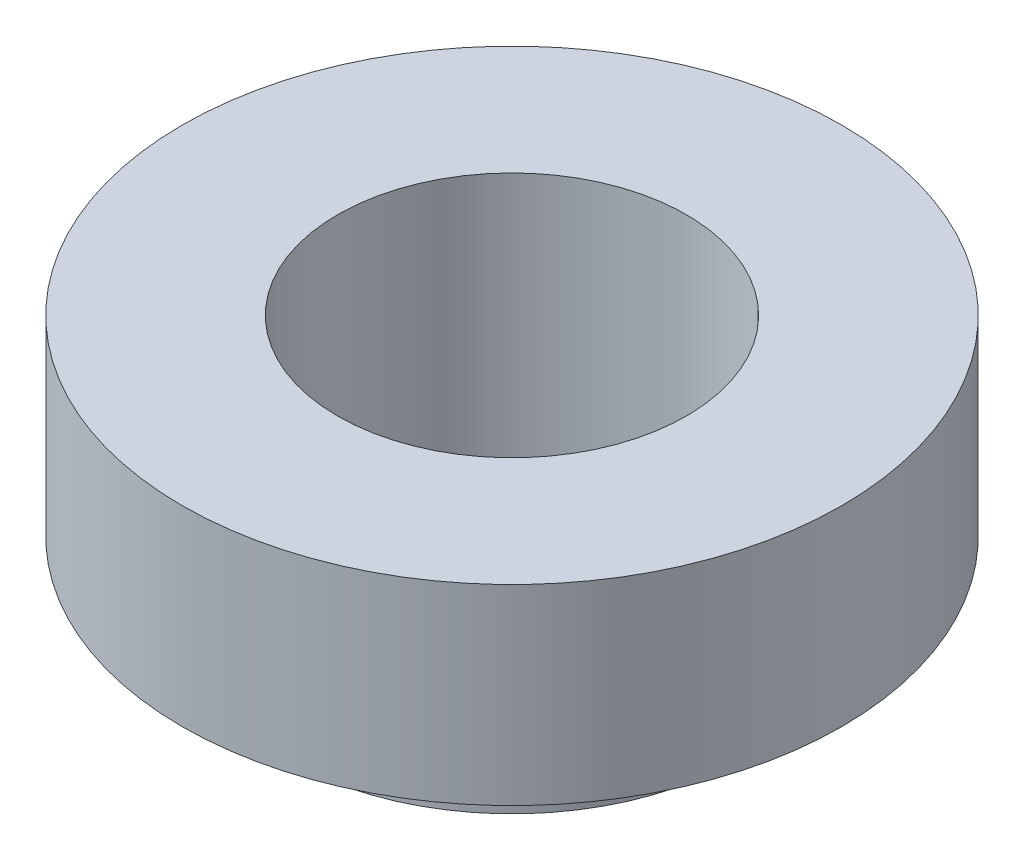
ISO-10303-21;
HEADER;
FILE_DESCRIPTION(('STEP AP214'),'2;1');
FILE_NAME('part.step','',(''),(''),'','','');
FILE_SCHEMA(('AUTOMOTIVE_DESIGN { 1 0 10303 214 1 1 1 1 }'));
ENDSEC;
DATA;
#1=APPLICATION_CONTEXT('core data for automotive mechanical design processes');
#2=APPLICATION_PROTOCOL_DEFINITION('international standard','automotive_design',2000,#1);
#3=PRODUCT_CONTEXT('',#1,'mechanical');
#4=PRODUCT('Part','Part','',(#3));
#5=PRODUCT_RELATED_PRODUCT_CATEGORY('part','',(#4));
#6=PRODUCT_DEFINITION_FORMATION('','',#4);
#7=PRODUCT_DEFINITION_CONTEXT('part definition',#1,'design');
#8=PRODUCT_DEFINITION('design','',#6,#7);
#9=PRODUCT_DEFINITION_SHAPE('','',#8);
#10=(LENGTH_UNIT() NAMED_UNIT(*) SI_UNIT(.MILLI.,.METRE.));
#11=(NAMED_UNIT(*) PLANE_ANGLE_UNIT() SI_UNIT($,.RADIAN.));
#12=(NAMED_UNIT(*) SI_UNIT($,.STERADIAN.) SOLID_ANGLE_UNIT());
#13=UNCERTAINTY_MEASURE_WITH_UNIT(LENGTH_MEASURE(1.E-05),#10,'distance_accuracy_value','');
#14=(GEOMETRIC_REPRESENTATION_CONTEXT(3) GLOBAL_UNCERTAINTY_ASSIGNED_CONTEXT((#13)) GLOBAL_UNIT_ASSIGNED_CONTEXT((#10,
#11,#12)) REPRESENTATION_CONTEXT('',''));
#15=CARTESIAN_POINT('',(0.,0.,0.));
#16=DIRECTION('',(0.,0.,1.));
#17=DIRECTION('',(1.,0.,0.));
#18=AXIS2_PLACEMENT_3D('',#15,#16,#17);
#19=CARTESIAN_POINT('',(0.,0.9652,0.));
#20=DIRECTION('',(0.,-1.,0.));
#21=DIRECTION('',(0.,0.,-1.));
#22=AXIS2_PLACEMENT_3D('',#19,#20,#21);
#23=CYLINDRICAL_SURFACE('',#22,2.6924);
#24=CARTESIAN_POINT('',(0.,0.9652,0.));
#25=DIRECTION('',(0.,1.,0.));
#26=DIRECTION('',(0.,0.,1.));
#27=AXIS2_PLACEMENT_3D('',#24,#25,#26);
#28=CIRCLE('',#27,2.6924);
#29=CARTESIAN_POINT('',(0.,0.9652,-2.6924));
#30=VERTEX_POINT('',#29);
#31=EDGE_CURVE('E10',#30,#30,#28,.T.);
#32=CARTESIAN_POINT('',(0.,0.,0.));
#33=DIRECTION('',(0.,1.,0.));
#34=DIRECTION('',(0.,0.,1.));
#35=AXIS2_PLACEMENT_3D('',#32,#33,#34);
#36=CIRCLE('',#35,2.6924);
#37=CARTESIAN_POINT('',(0.,0.,-2.6924));
#38=VERTEX_POINT('',#37);
#39=EDGE_CURVE('E33',#38,#38,#36,.T.);
#40=CARTESIAN_POINT('',(0.,0.9652,-2.6924));
#41=CARTESIAN_POINT('',(0.,0.955145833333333,-2.6924));
#42=CARTESIAN_POINT('',(0.,0.945091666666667,-2.6924));
#43=CARTESIAN_POINT('',(0.,0.924983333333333,-2.6924));
#44=CARTESIAN_POINT('',(0.,0.914929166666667,-2.6924));
#45=CARTESIAN_POINT('',(0.,0.894820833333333,-2.6924));
#46=CARTESIAN_POINT('',(0.,0.884766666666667,-2.6924));
#47=CARTESIAN_POINT('',(0.,0.864658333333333,-2.6924));
#48=CARTESIAN_POINT('',(0.,0.854604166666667,-2.6924));
#49=CARTESIAN_POINT('',(0.,0.834495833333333,-2.6924));
#50=CARTESIAN_POINT('',(0.,0.824441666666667,-2.6924));
#51=CARTESIAN_POINT('',(0.,0.804333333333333,-2.6924));
#52=CARTESIAN_POINT('',(0.,0.794279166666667,-2.6924));
#53=CARTESIAN_POINT('',(0.,0.774170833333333,-2.6924));
#54=CARTESIAN_POINT('',(0.,0.764116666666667,-2.6924));
#55=CARTESIAN_POINT('',(0.,0.744008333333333,-2.6924));
#56=CARTESIAN_POINT('',(0.,0.733954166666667,-2.6924));
#57=CARTESIAN_POINT('',(0.,0.713845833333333,-2.6924));
#58=CARTESIAN_POINT('',(0.,0.703791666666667,-2.6924));
#59=CARTESIAN_POINT('',(0.,0.683683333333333,-2.6924));
#60=CARTESIAN_POINT('',(0.,0.673629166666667,-2.6924));
#61=CARTESIAN_POINT('',(0.,0.653520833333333,-2.6924));
#62=CARTESIAN_POINT('',(0.,0.643466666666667,-2.6924));
#63=CARTESIAN_POINT('',(0.,0.623358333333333,-2.6924));
#64=CARTESIAN_POINT('',(0.,0.613304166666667,-2.6924));
#65=CARTESIAN_POINT('',(0.,0.593195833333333,-2.6924));
#66=CARTESIAN_POINT('',(0.,0.583141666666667,-2.6924));
#67=CARTESIAN_POINT('',(0.,0.563033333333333,-2.6924));
#68=CARTESIAN_POINT('',(0.,0.552979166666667,-2.6924));
#69=CARTESIAN_POINT('',(0.,0.532870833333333,-2.6924));
#70=CARTESIAN_POINT('',(0.,0.522816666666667,-2.6924));
#71=CARTESIAN_POINT('',(0.,0.502708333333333,-2.6924));
#72=CARTESIAN_POINT('',(0.,0.492654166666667,-2.6924));
#73=CARTESIAN_POINT('',(0.,0.472545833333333,-2.6924));
#74=CARTESIAN_POINT('',(0.,0.462491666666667,-2.6924));
#75=CARTESIAN_POINT('',(0.,0.442383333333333,-2.6924));
#76=CARTESIAN_POINT('',(0.,0.432329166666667,-2.6924));
#77=CARTESIAN_POINT('',(0.,0.412220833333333,-2.6924));
#78=CARTESIAN_POINT('',(0.,0.402166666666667,-2.6924));
#79=CARTESIAN_POINT('',(0.,0.382058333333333,-2.6924));
#80=CARTESIAN_POINT('',(0.,0.372004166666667,-2.6924));
#81=CARTESIAN_POINT('',(0.,0.351895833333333,-2.6924));
#82=CARTESIAN_POINT('',(0.,0.341841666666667,-2.6924));
#83=CARTESIAN_POINT('',(0.,0.321733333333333,-2.6924));
#84=CARTESIAN_POINT('',(0.,0.311679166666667,-2.6924));
#85=CARTESIAN_POINT('',(0.,0.291570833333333,-2.6924));
#86=CARTESIAN_POINT('',(0.,0.281516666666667,-2.6924));
#87=CARTESIAN_POINT('',(0.,0.261408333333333,-2.6924));
#88=CARTESIAN_POINT('',(0.,0.251354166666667,-2.6924));
#89=CARTESIAN_POINT('',(0.,0.231245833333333,-2.6924));
#90=CARTESIAN_POINT('',(0.,0.221191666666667,-2.6924));
#91=CARTESIAN_POINT('',(0.,0.201083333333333,-2.6924));
#92=CARTESIAN_POINT('',(0.,0.191029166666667,-2.6924));
#93=CARTESIAN_POINT('',(0.,0.170920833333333,-2.6924));
#94=CARTESIAN_POINT('',(0.,0.160866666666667,-2.6924));
#95=CARTESIAN_POINT('',(0.,0.140758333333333,-2.6924));
#96=CARTESIAN_POINT('',(0.,0.130704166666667,-2.6924));
#97=CARTESIAN_POINT('',(0.,0.110595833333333,-2.6924));
#98=CARTESIAN_POINT('',(0.,0.100541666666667,-2.6924));
#99=CARTESIAN_POINT('',(0.,0.0804333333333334,-2.6924));
#100=CARTESIAN_POINT('',(0.,0.0703791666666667,-2.6924));
#101=CARTESIAN_POINT('',(0.,0.0502708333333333,-2.6924));
#102=CARTESIAN_POINT('',(0.,0.0402166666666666,-2.6924));
#103=CARTESIAN_POINT('',(0.,0.0201083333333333,-2.6924));
#104=CARTESIAN_POINT('',(0.,0.0100541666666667,-2.6924));
#105=CARTESIAN_POINT('',(0.,0.,-2.6924));
#106=B_SPLINE_CURVE_WITH_KNOTS('',3,(#40,#41,#42,#43,#44,#45,#46,#47,#48,#49,#50,#51,#52,#53,
#54,#55,#56,#57,#58,#59,#60,#61,#62,#63,#64,#65,#66,#67,#68,#69,#70,#71,#72,#73,#74,#75,#76,#77,
#78,#79,#80,#81,#82,#83,#84,#85,#86,#87,#88,#89,#90,#91,#92,#93,#94,#95,#96,#97,#98,#99,#100,
#101,#102,#103,#104,#105),.UNSPECIFIED.,.F.,.F.,(4,2,2,2,2,2,2,2,2,2,2,2,2,2,2,2,2,2,2,2,2,2,2,
2,2,2,2,2,2,2,2,2,4),(0.,0.0301625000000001,0.0603250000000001,0.0904875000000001,0.12065,
0.1508125,0.180975,0.2111375,0.2413,0.2714625,0.301625,0.3317875,0.36195,0.3921125,0.422275,
0.4524375,0.4826,0.5127625,0.542925,0.5730875,0.60325,0.6334125,0.663575,0.6937375,0.7239,
0.7540625,0.784225,0.8143875,0.84455,0.8747125,0.904875,0.9350375,0.9652),.UNSPECIFIED.);
#107=EDGE_CURVE('BSEAM30',#30,#38,#106,.T.);
#108=ORIENTED_EDGE('',*,*,#31,.F.);
#109=ORIENTED_EDGE('',*,*,#39,.T.);
#110=ORIENTED_EDGE('',*,*,#107,.T.);
#111=ORIENTED_EDGE('',*,*,#107,.F.);
#112=EDGE_LOOP('',(#108,#110,#109,#111));
#113=FACE_BOUND('',#112,.T.);
#114=ADVANCED_FACE('F30',(#113),#23,.T.);
#115=CARTESIAN_POINT('',(0.,0.,0.));
#116=DIRECTION('',(0.,1.,0.));
#117=DIRECTION('',(0.,0.,1.));
#118=AXIS2_PLACEMENT_3D('',#115,#116,#117);
#119=PLANE('',#118);
#120=CARTESIAN_POINT('',(0.,0.,0.));
#121=DIRECTION('',(0.,1.,0.));
#122=DIRECTION('',(0.,0.,1.));
#123=AXIS2_PLACEMENT_3D('',#120,#121,#122);
#124=CIRCLE('',#123,2.0828);
#125=CARTESIAN_POINT('',(0.,0.,2.0828));
#126=VERTEX_POINT('',#125);
#127=EDGE_CURVE('E45',#126,#126,#124,.T.);
#128=ORIENTED_EDGE('',*,*,#127,.T.);
#129=EDGE_LOOP('',(#128));
#130=FACE_BOUND('',#129,.T.);
#131=ORIENTED_EDGE('',*,*,#39,.F.);
#132=EDGE_LOOP('',(#131));
#133=FACE_BOUND('',#132,.T.);
#134=ADVANCED_FACE('F54',(#130,#133),#119,.F.);
#135=CARTESIAN_POINT('',(0.,0.9652,0.));
#136=DIRECTION('',(0.,1.,0.));
#137=DIRECTION('',(0.,0.,1.));
#138=AXIS2_PLACEMENT_3D('',#135,#136,#137);
#139=PLANE('',#138);
#140=CARTESIAN_POINT('',(0.,0.9652,0.));
#141=DIRECTION('',(0.,1.,0.));
#142=DIRECTION('',(0.,0.,1.));
#143=AXIS2_PLACEMENT_3D('',#140,#141,#142);
#144=CIRCLE('',#143,3.937);
#145=CARTESIAN_POINT('',(0.,0.9652,3.937));
#146=VERTEX_POINT('',#145);
#147=EDGE_CURVE('E42',#146,#146,#144,.T.);
#148=ORIENTED_EDGE('',*,*,#147,.F.);
#149=EDGE_LOOP('',(#148));
#150=FACE_BOUND('',#149,.T.);
#151=ORIENTED_EDGE('',*,*,#31,.T.);
#152=EDGE_LOOP('',(#151));
#153=FACE_BOUND('',#152,.T.);
#154=ADVANCED_FACE('F72',(#150,#153),#139,.F.);
#155=CARTESIAN_POINT('',(0.,3.2512,0.));
#156=DIRECTION('',(0.,-1.,0.));
#157=DIRECTION('',(0.,0.,-1.));
#158=AXIS2_PLACEMENT_3D('',#155,#156,#157);
#159=CYLINDRICAL_SURFACE('',#158,3.937);
#160=CARTESIAN_POINT('',(0.,3.2512,0.));
#161=DIRECTION('',(0.,1.,0.));
#162=DIRECTION('',(0.,0.,1.));
#163=AXIS2_PLACEMENT_3D('',#160,#161,#162);
#164=CIRCLE('',#163,3.937);
#165=CARTESIAN_POINT('',(0.,3.2512,3.937));
#166=VERTEX_POINT('',#165);
#167=EDGE_CURVE('E40',#166,#166,#164,.T.);
#168=ORIENTED_EDGE('',*,*,#167,.F.);
#169=EDGE_LOOP('',(#168));
#170=FACE_BOUND('',#169,.T.);
#171=ORIENTED_EDGE('',*,*,#147,.T.);
#172=EDGE_LOOP('',(#171));
#173=FACE_BOUND('',#172,.T.);
#174=ADVANCED_FACE('F66',(#170,#173),#159,.T.);
#175=CARTESIAN_POINT('',(0.,3.2512,0.));
#176=DIRECTION('',(0.,1.,0.));
#177=DIRECTION('',(0.,0.,1.));
#178=AXIS2_PLACEMENT_3D('',#175,#176,#177);
#179=PLANE('',#178);
#180=CARTESIAN_POINT('',(0.,3.2512,0.));
#181=DIRECTION('',(0.,1.,0.));
#182=DIRECTION('',(0.,0.,1.));
#183=AXIS2_PLACEMENT_3D('',#180,#181,#182);
#184=CIRCLE('',#183,2.0828);
#185=CARTESIAN_POINT('',(0.,3.2512,2.0828));
#186=VERTEX_POINT('',#185);
#187=EDGE_CURVE('E48',#186,#186,#184,.T.);
#188=ORIENTED_EDGE('',*,*,#187,.F.);
#189=EDGE_LOOP('',(#188));
#190=FACE_BOUND('',#189,.T.);
#191=ORIENTED_EDGE('',*,*,#167,.T.);
#192=EDGE_LOOP('',(#191));
#193=FACE_BOUND('',#192,.T.);
#194=ADVANCED_FACE('F60',(#190,#193),#179,.T.);
#195=CARTESIAN_POINT('',(0.,0.,0.));
#196=DIRECTION('',(0.,1.,0.));
#197=DIRECTION('',(0.,0.,1.));
#198=AXIS2_PLACEMENT_3D('',#195,#196,#197);
#199=CYLINDRICAL_SURFACE('',#198,2.0828);
#200=ORIENTED_EDGE('',*,*,#127,.F.);
#201=EDGE_LOOP('',(#200));
#202=FACE_BOUND('',#201,.T.);
#203=ORIENTED_EDGE('',*,*,#187,.T.);
#204=EDGE_LOOP('',(#203));
#205=FACE_BOUND('',#204,.T.);
#206=ADVANCED_FACE('F57',(#202,#205),#199,.F.);
#207=CLOSED_SHELL('',(#114,#134,#154,#174,#194,#206));
#208=MANIFOLD_SOLID_BREP('B2',#207);
#209=ADVANCED_BREP_SHAPE_REPRESENTATION('',(#18,#208),#14);
#210=SHAPE_DEFINITION_REPRESENTATION(#9,#209);
ENDSEC;
END-ISO-10303-21;
